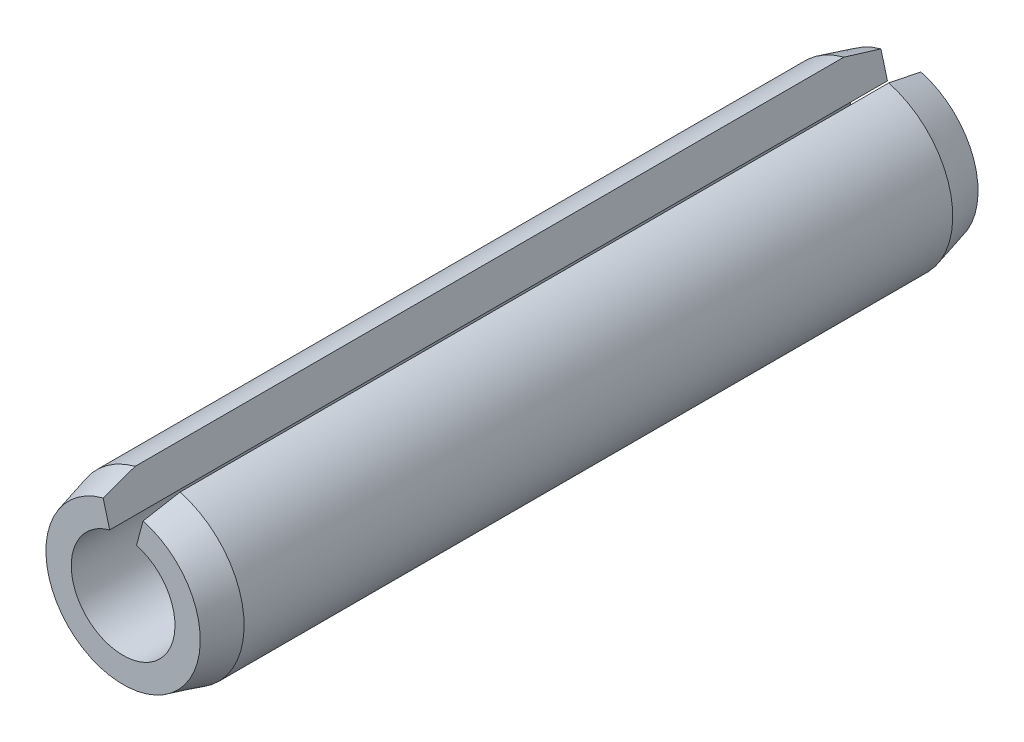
ISO-10303-21;
HEADER;
FILE_DESCRIPTION(('STEP AP214'),'2;1');
FILE_NAME('part.step','',(''),(''),'','','');
FILE_SCHEMA(('AUTOMOTIVE_DESIGN { 1 0 10303 214 1 1 1 1 }'));
ENDSEC;
DATA;
#1=APPLICATION_CONTEXT('core data for automotive mechanical design processes');
#2=APPLICATION_PROTOCOL_DEFINITION('international standard','automotive_design',2000,#1);
#3=PRODUCT_CONTEXT('',#1,'mechanical');
#4=PRODUCT('Part','Part','',(#3));
#5=PRODUCT_RELATED_PRODUCT_CATEGORY('part','',(#4));
#6=PRODUCT_DEFINITION_FORMATION('','',#4);
#7=PRODUCT_DEFINITION_CONTEXT('part definition',#1,'design');
#8=PRODUCT_DEFINITION('design','',#6,#7);
#9=PRODUCT_DEFINITION_SHAPE('','',#8);
#10=(LENGTH_UNIT() NAMED_UNIT(*) SI_UNIT(.MILLI.,.METRE.));
#11=(NAMED_UNIT(*) PLANE_ANGLE_UNIT() SI_UNIT($,.RADIAN.));
#12=(NAMED_UNIT(*) SI_UNIT($,.STERADIAN.) SOLID_ANGLE_UNIT());
#13=UNCERTAINTY_MEASURE_WITH_UNIT(LENGTH_MEASURE(1.E-05),#10,'distance_accuracy_value','');
#14=(GEOMETRIC_REPRESENTATION_CONTEXT(3) GLOBAL_UNCERTAINTY_ASSIGNED_CONTEXT((#13)) GLOBAL_UNIT_ASSIGNED_CONTEXT((#10,
#11,#12)) REPRESENTATION_CONTEXT('',''));
#15=CARTESIAN_POINT('',(0.,0.,0.));
#16=DIRECTION('',(0.,0.,1.));
#17=DIRECTION('',(1.,0.,0.));
#18=AXIS2_PLACEMENT_3D('',#15,#16,#17);
#19=CARTESIAN_POINT('',(0.,0.,22.5));
#20=DIRECTION('',(0.,0.,-1.));
#21=DIRECTION('',(-1.,0.,0.));
#22=AXIS2_PLACEMENT_3D('',#19,#20,#21);
#23=CYLINDRICAL_SURFACE('',#22,3.);
#24=CARTESIAN_POINT('',(0.,0.,-22.5));
#25=DIRECTION('',(0.,0.,-1.));
#26=DIRECTION('',(0.,1.,0.));
#27=AXIS2_PLACEMENT_3D('',#24,#25,#26);
#28=CIRCLE('',#27,3.);
#29=CARTESIAN_POINT('',(0.776457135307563,2.89777747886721,-22.5));
#30=VERTEX_POINT('',#29);
#31=CARTESIAN_POINT('',(-0.776457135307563,2.89777747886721,-22.5));
#32=VERTEX_POINT('',#31);
#33=EDGE_CURVE('E73',#30,#32,#28,.T.);
#34=ORIENTED_EDGE('',*,*,#33,.T.);
#35=DIRECTION('',(0.,0.,-1.));
#36=VECTOR('',#35,1.);
#37=CARTESIAN_POINT('',(-0.776457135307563,2.89777747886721,22.5));
#38=LINE('',#37,#36);
#39=CARTESIAN_POINT('',(-0.776457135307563,2.89777747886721,22.5));
#40=VERTEX_POINT('',#39);
#41=EDGE_CURVE('E79',#40,#32,#38,.T.);
#42=ORIENTED_EDGE('',*,*,#41,.F.);
#43=CARTESIAN_POINT('',(0.,0.,22.5));
#44=DIRECTION('',(0.,0.,-1.));
#45=DIRECTION('',(0.,1.,0.));
#46=AXIS2_PLACEMENT_3D('',#43,#44,#45);
#47=CIRCLE('',#46,3.);
#48=CARTESIAN_POINT('',(0.776457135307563,2.89777747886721,22.5));
#49=VERTEX_POINT('',#48);
#50=EDGE_CURVE('E100',#49,#40,#47,.T.);
#51=ORIENTED_EDGE('',*,*,#50,.F.);
#52=DIRECTION('',(0.,0.,-1.));
#53=VECTOR('',#52,1.);
#54=CARTESIAN_POINT('',(0.776457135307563,2.89777747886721,22.5));
#55=LINE('',#54,#53);
#56=EDGE_CURVE('E90',#49,#30,#55,.T.);
#57=ORIENTED_EDGE('',*,*,#56,.T.);
#58=EDGE_LOOP('',(#34,#42,#51,#57));
#59=FACE_BOUND('',#58,.T.);
#60=ADVANCED_FACE('F17',(#59),#23,.F.);
#61=CARTESIAN_POINT('',(-0.776457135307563,2.89777747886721,22.5));
#62=DIRECTION('',(-0.965925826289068,-0.258819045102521,0.));
#63=DIRECTION('',(0.258819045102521,-0.965925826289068,0.));
#64=AXIS2_PLACEMENT_3D('',#61,#62,#63);
#65=PLANE('',#64);
#66=DIRECTION('',(-0.258819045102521,0.965925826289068,0.));
#67=VECTOR('',#66,1.);
#68=CARTESIAN_POINT('',(-0.776457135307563,2.89777747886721,-22.5));
#69=LINE('',#68,#67);
#70=CARTESIAN_POINT('',(-1.15539451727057,4.3119910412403,-22.5));
#71=VERTEX_POINT('',#70);
#72=EDGE_CURVE('E69',#32,#71,#69,.T.);
#73=ORIENTED_EDGE('',*,*,#72,.T.);
#74=DIRECTION('',(0.0669872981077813,-0.250000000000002,-0.965925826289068));
#75=VECTOR('',#74,1.);
#76=CARTESIAN_POINT('',(0.,0.,-39.1602540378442));
#77=LINE('',#76,#75);
#78=CARTESIAN_POINT('',(-1.29409522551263,4.82962913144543,-20.4999999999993));
#79=VERTEX_POINT('',#78);
#80=EDGE_CURVE('E24',#71,#79,#77,.F.);
#81=ORIENTED_EDGE('',*,*,#80,.T.);
#82=DIRECTION('',(0.,0.,-1.));
#83=VECTOR('',#82,1.);
#84=CARTESIAN_POINT('',(-1.2940952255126,4.82962913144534,22.5));
#85=LINE('',#84,#83);
#86=CARTESIAN_POINT('',(-1.29409522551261,4.82962913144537,20.4999999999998));
#87=VERTEX_POINT('',#86);
#88=EDGE_CURVE('E86',#87,#79,#85,.T.);
#89=ORIENTED_EDGE('',*,*,#88,.F.);
#90=DIRECTION('',(-0.0669872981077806,0.25,-0.965925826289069));
#91=VECTOR('',#90,1.);
#92=CARTESIAN_POINT('',(0.,0.,39.1602540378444));
#93=LINE('',#92,#91);
#94=CARTESIAN_POINT('',(-1.15539451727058,4.3119910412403,22.5));
#95=VERTEX_POINT('',#94);
#96=EDGE_CURVE('E31',#87,#95,#93,.F.);
#97=ORIENTED_EDGE('',*,*,#96,.T.);
#98=DIRECTION('',(-0.258819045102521,0.965925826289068,0.));
#99=VECTOR('',#98,1.);
#100=CARTESIAN_POINT('',(-0.776457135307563,2.89777747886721,22.5));
#101=LINE('',#100,#99);
#102=EDGE_CURVE('E81',#40,#95,#101,.T.);
#103=ORIENTED_EDGE('',*,*,#102,.F.);
#104=ORIENTED_EDGE('',*,*,#41,.T.);
#105=EDGE_LOOP('',(#73,#81,#89,#97,#103,#104));
#106=FACE_BOUND('',#105,.T.);
#107=ADVANCED_FACE('F80',(#106),#65,.F.);
#108=CARTESIAN_POINT('',(0.,0.,22.5));
#109=DIRECTION('',(0.,0.,-1.));
#110=DIRECTION('',(-1.,0.,0.));
#111=AXIS2_PLACEMENT_3D('',#108,#109,#110);
#112=CYLINDRICAL_SURFACE('',#111,5.);
#113=ORIENTED_EDGE('',*,*,#88,.T.);
#114=CARTESIAN_POINT('',(0.,0.,-20.5));
#115=DIRECTION('',(0.,0.,-1.));
#116=DIRECTION('',(-1.,0.,0.));
#117=AXIS2_PLACEMENT_3D('',#114,#115,#116);
#118=CIRCLE('',#117,5.);
#119=CARTESIAN_POINT('',(1.29409522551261,4.82962913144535,-20.4999999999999));
#120=VERTEX_POINT('',#119);
#121=EDGE_CURVE('E110',#79,#120,#118,.F.);
#122=ORIENTED_EDGE('',*,*,#121,.T.);
#123=DIRECTION('',(0.,0.,-1.));
#124=VECTOR('',#123,1.);
#125=CARTESIAN_POINT('',(1.2940952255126,4.82962913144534,22.5));
#126=LINE('',#125,#124);
#127=CARTESIAN_POINT('',(1.2940952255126,4.82962913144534,20.5));
#128=VERTEX_POINT('',#127);
#129=EDGE_CURVE('E104',#128,#120,#126,.T.);
#130=ORIENTED_EDGE('',*,*,#129,.F.);
#131=CARTESIAN_POINT('',(0.,0.,20.5));
#132=DIRECTION('',(0.,0.,-1.));
#133=DIRECTION('',(-1.,0.,0.));
#134=AXIS2_PLACEMENT_3D('',#131,#132,#133);
#135=CIRCLE('',#134,5.);
#136=EDGE_CURVE('E85',#128,#87,#135,.T.);
#137=ORIENTED_EDGE('',*,*,#136,.T.);
#138=EDGE_LOOP('',(#113,#122,#130,#137));
#139=FACE_BOUND('',#138,.T.);
#140=ADVANCED_FACE('F121',(#139),#112,.T.);
#141=CARTESIAN_POINT('',(0.776457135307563,2.89777747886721,22.5));
#142=DIRECTION('',(0.965925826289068,-0.258819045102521,0.));
#143=DIRECTION('',(0.258819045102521,0.965925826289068,0.));
#144=AXIS2_PLACEMENT_3D('',#141,#142,#143);
#145=PLANE('',#144);
#146=ORIENTED_EDGE('',*,*,#129,.T.);
#147=DIRECTION('',(0.0669872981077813,0.250000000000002,0.965925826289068));
#148=VECTOR('',#147,1.);
#149=CARTESIAN_POINT('',(0.,0.,-39.1602540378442));
#150=LINE('',#149,#148);
#151=CARTESIAN_POINT('',(1.15539451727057,4.31199104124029,-22.5));
#152=VERTEX_POINT('',#151);
#153=EDGE_CURVE('E115',#120,#152,#150,.F.);
#154=ORIENTED_EDGE('',*,*,#153,.T.);
#155=DIRECTION('',(-0.258819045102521,-0.965925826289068,0.));
#156=VECTOR('',#155,1.);
#157=CARTESIAN_POINT('',(0.776457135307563,2.89777747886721,-22.5));
#158=LINE('',#157,#156);
#159=EDGE_CURVE('E76',#152,#30,#158,.T.);
#160=ORIENTED_EDGE('',*,*,#159,.T.);
#161=ORIENTED_EDGE('',*,*,#56,.F.);
#162=DIRECTION('',(-0.258819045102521,-0.965925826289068,0.));
#163=VECTOR('',#162,1.);
#164=CARTESIAN_POINT('',(0.776457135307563,2.89777747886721,22.5));
#165=LINE('',#164,#163);
#166=CARTESIAN_POINT('',(1.15539451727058,4.3119910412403,22.5));
#167=VERTEX_POINT('',#166);
#168=EDGE_CURVE('E99',#167,#49,#165,.T.);
#169=ORIENTED_EDGE('',*,*,#168,.F.);
#170=DIRECTION('',(-0.0669872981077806,-0.25,0.965925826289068));
#171=VECTOR('',#170,1.);
#172=CARTESIAN_POINT('',(0.,0.,39.1602540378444));
#173=LINE('',#172,#171);
#174=EDGE_CURVE('E113',#167,#128,#173,.F.);
#175=ORIENTED_EDGE('',*,*,#174,.T.);
#176=EDGE_LOOP('',(#146,#154,#160,#161,#169,#175));
#177=FACE_BOUND('',#176,.T.);
#178=ADVANCED_FACE('F126',(#177),#145,.F.);
#179=CARTESIAN_POINT('',(0.,0.,22.5));
#180=DIRECTION('',(0.,0.,-1.));
#181=DIRECTION('',(-1.,0.,0.));
#182=AXIS2_PLACEMENT_3D('',#179,#180,#181);
#183=PLANE('',#182);
#184=ORIENTED_EDGE('',*,*,#102,.T.);
#185=CARTESIAN_POINT('',(0.,0.,22.5));
#186=DIRECTION('',(0.,0.,-1.));
#187=DIRECTION('',(-1.,0.,0.));
#188=AXIS2_PLACEMENT_3D('',#185,#186,#187);
#189=CIRCLE('',#188,4.46410161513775);
#190=EDGE_CURVE('E11',#95,#167,#189,.F.);
#191=ORIENTED_EDGE('',*,*,#190,.T.);
#192=ORIENTED_EDGE('',*,*,#168,.T.);
#193=ORIENTED_EDGE('',*,*,#50,.T.);
#194=EDGE_LOOP('',(#184,#191,#192,#193));
#195=FACE_BOUND('',#194,.T.);
#196=ADVANCED_FACE('F135',(#195),#183,.F.);
#197=CARTESIAN_POINT('',(0.,0.,-22.5));
#198=DIRECTION('',(0.,0.,-1.));
#199=DIRECTION('',(-1.,0.,0.));
#200=AXIS2_PLACEMENT_3D('',#197,#198,#199);
#201=PLANE('',#200);
#202=ORIENTED_EDGE('',*,*,#159,.F.);
#203=CARTESIAN_POINT('',(0.,0.,-22.5));
#204=DIRECTION('',(0.,0.,-1.));
#205=DIRECTION('',(-1.,0.,0.));
#206=AXIS2_PLACEMENT_3D('',#203,#204,#205);
#207=CIRCLE('',#206,4.46410161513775);
#208=EDGE_CURVE('E39',#152,#71,#207,.T.);
#209=ORIENTED_EDGE('',*,*,#208,.T.);
#210=ORIENTED_EDGE('',*,*,#72,.F.);
#211=ORIENTED_EDGE('',*,*,#33,.F.);
#212=EDGE_LOOP('',(#202,#209,#210,#211));
#213=FACE_BOUND('',#212,.T.);
#214=ADVANCED_FACE('F71',(#213),#201,.T.);
#215=CARTESIAN_POINT('',(0.,0.,-20.5));
#216=DIRECTION('',(0.,0.,1.));
#217=DIRECTION('',(1.,0.,0.));
#218=AXIS2_PLACEMENT_3D('',#215,#216,#217);
#219=CONICAL_SURFACE('',#218,5.,0.261799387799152);
#220=ORIENTED_EDGE('',*,*,#80,.F.);
#221=ORIENTED_EDGE('',*,*,#208,.F.);
#222=ORIENTED_EDGE('',*,*,#153,.F.);
#223=ORIENTED_EDGE('',*,*,#121,.F.);
#224=EDGE_LOOP('',(#220,#221,#222,#223));
#225=FACE_BOUND('',#224,.T.);
#226=ADVANCED_FACE('F124',(#225),#219,.T.);
#227=CARTESIAN_POINT('',(0.,0.,22.5));
#228=DIRECTION('',(0.,0.,-1.));
#229=DIRECTION('',(-1.,0.,0.));
#230=AXIS2_PLACEMENT_3D('',#227,#228,#229);
#231=CONICAL_SURFACE('',#230,4.46410161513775,0.261799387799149);
#232=ORIENTED_EDGE('',*,*,#96,.F.);
#233=ORIENTED_EDGE('',*,*,#136,.F.);
#234=ORIENTED_EDGE('',*,*,#174,.F.);
#235=ORIENTED_EDGE('',*,*,#190,.F.);
#236=EDGE_LOOP('',(#232,#233,#234,#235));
#237=FACE_BOUND('',#236,.T.);
#238=ADVANCED_FACE('F132',(#237),#231,.T.);
#239=CLOSED_SHELL('',(#60,#107,#140,#178,#196,#214,#226,#238));
#240=MANIFOLD_SOLID_BREP('B1',#239);
#241=ADVANCED_BREP_SHAPE_REPRESENTATION('',(#18,#240),#14);
#242=SHAPE_DEFINITION_REPRESENTATION(#9,#241);
ENDSEC;
END-ISO-10303-21;
